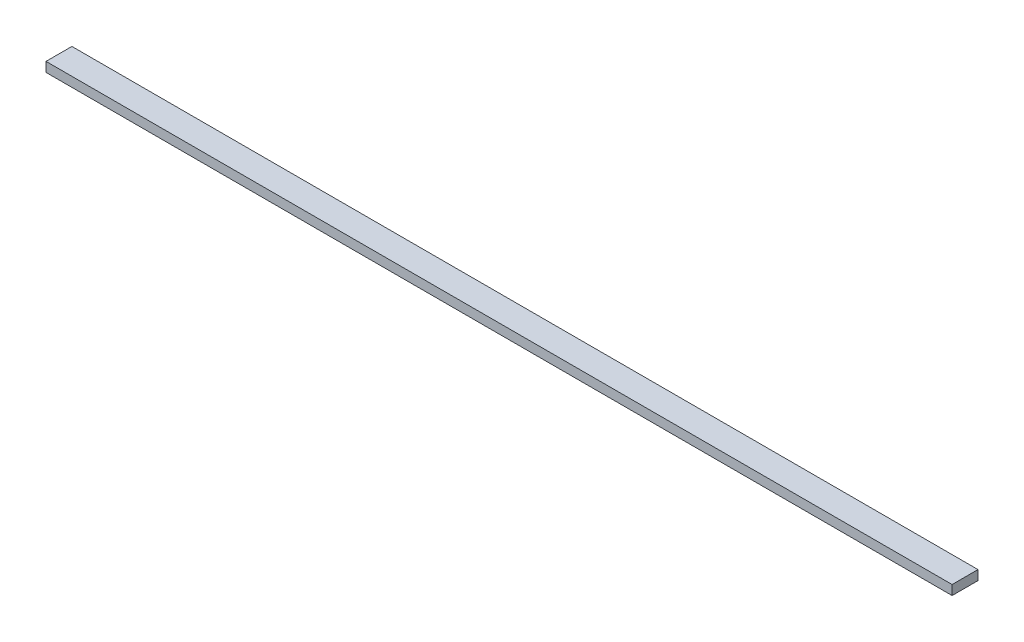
from build123d import *

# Parameters (mm, degrees)
SKETCH1_W           = 600.075
SKETCH1_H           = 17.145
BOSS_EXTRUDE1_DEPTH = 6.35


with BuildPart() as part:
    # Sketch1 → Boss-Extrude1 (new body)
    with BuildSketch(Plane(origin=(0, 0, 0), x_dir=(1, 0, 0), z_dir=(0, 1, 0))):
        Rectangle(SKETCH1_W, SKETCH1_H)
    extrude(amount=BOSS_EXTRUDE1_DEPTH)


solid = part.part
